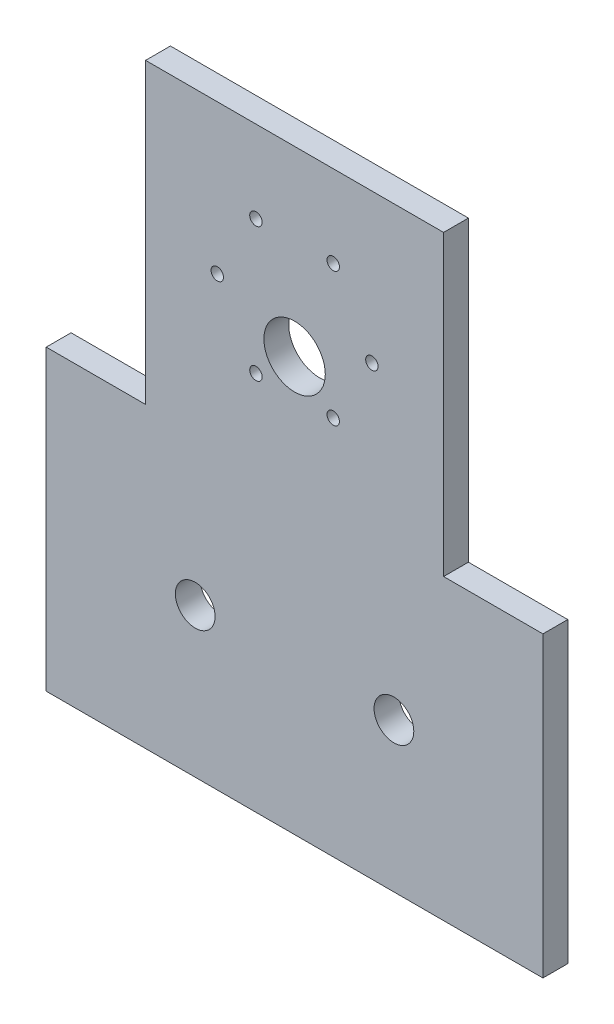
ISO-10303-21;
HEADER;
FILE_DESCRIPTION(('STEP AP214'),'2;1');
FILE_NAME('part.step','',(''),(''),'','','');
FILE_SCHEMA(('AUTOMOTIVE_DESIGN { 1 0 10303 214 1 1 1 1 }'));
ENDSEC;
DATA;
#1=APPLICATION_CONTEXT('core data for automotive mechanical design processes');
#2=APPLICATION_PROTOCOL_DEFINITION('international standard','automotive_design',2000,#1);
#3=PRODUCT_CONTEXT('',#1,'mechanical');
#4=PRODUCT('Part','Part','',(#3));
#5=PRODUCT_RELATED_PRODUCT_CATEGORY('part','',(#4));
#6=PRODUCT_DEFINITION_FORMATION('','',#4);
#7=PRODUCT_DEFINITION_CONTEXT('part definition',#1,'design');
#8=PRODUCT_DEFINITION('design','',#6,#7);
#9=PRODUCT_DEFINITION_SHAPE('','',#8);
#10=(LENGTH_UNIT() NAMED_UNIT(*) SI_UNIT(.MILLI.,.METRE.));
#11=(NAMED_UNIT(*) PLANE_ANGLE_UNIT() SI_UNIT($,.RADIAN.));
#12=(NAMED_UNIT(*) SI_UNIT($,.STERADIAN.) SOLID_ANGLE_UNIT());
#13=UNCERTAINTY_MEASURE_WITH_UNIT(LENGTH_MEASURE(1.E-05),#10,'distance_accuracy_value','');
#14=(GEOMETRIC_REPRESENTATION_CONTEXT(3) GLOBAL_UNCERTAINTY_ASSIGNED_CONTEXT((#13)) GLOBAL_UNIT_ASSIGNED_CONTEXT((#10,
#11,#12)) REPRESENTATION_CONTEXT('',''));
#15=CARTESIAN_POINT('',(0.,0.,0.));
#16=DIRECTION('',(0.,0.,1.));
#17=DIRECTION('',(1.,0.,0.));
#18=AXIS2_PLACEMENT_3D('',#15,#16,#17);
#19=CARTESIAN_POINT('',(0.,0.,5.));
#20=DIRECTION('',(0.,0.,-1.));
#21=DIRECTION('',(-1.,0.,0.));
#22=AXIS2_PLACEMENT_3D('',#19,#20,#21);
#23=PLANE('',#22);
#24=DIRECTION('',(0.,1.,0.));
#25=VECTOR('',#24,1.);
#26=CARTESIAN_POINT('',(0.,0.,5.));
#27=LINE('',#26,#25);
#28=CARTESIAN_POINT('',(0.,0.,5.));
#29=VERTEX_POINT('',#28);
#30=CARTESIAN_POINT('',(0.,60.,5.));
#31=VERTEX_POINT('',#30);
#32=EDGE_CURVE('E423',#29,#31,#27,.T.);
#33=ORIENTED_EDGE('',*,*,#32,.F.);
#34=DIRECTION('',(1.,0.,0.));
#35=VECTOR('',#34,1.);
#36=CARTESIAN_POINT('',(0.,0.,5.));
#37=LINE('',#36,#35);
#38=CARTESIAN_POINT('',(100.,0.,5.));
#39=VERTEX_POINT('',#38);
#40=EDGE_CURVE('E358',#29,#39,#37,.T.);
#41=ORIENTED_EDGE('',*,*,#40,.T.);
#42=DIRECTION('',(0.,1.,0.));
#43=VECTOR('',#42,1.);
#44=CARTESIAN_POINT('',(100.,0.,5.));
#45=LINE('',#44,#43);
#46=CARTESIAN_POINT('',(100.,60.,5.));
#47=VERTEX_POINT('',#46);
#48=EDGE_CURVE('E350',#39,#47,#45,.T.);
#49=ORIENTED_EDGE('',*,*,#48,.T.);
#50=DIRECTION('',(1.,0.,0.));
#51=VECTOR('',#50,1.);
#52=CARTESIAN_POINT('',(80.,60.,5.));
#53=LINE('',#52,#51);
#54=CARTESIAN_POINT('',(80.,60.,5.));
#55=VERTEX_POINT('',#54);
#56=EDGE_CURVE('E356',#55,#47,#53,.T.);
#57=ORIENTED_EDGE('',*,*,#56,.F.);
#58=DIRECTION('',(0.,-1.,0.));
#59=VECTOR('',#58,1.);
#60=CARTESIAN_POINT('',(80.,120.,5.));
#61=LINE('',#60,#59);
#62=CARTESIAN_POINT('',(80.,120.,5.));
#63=VERTEX_POINT('',#62);
#64=EDGE_CURVE('E372',#63,#55,#61,.T.);
#65=ORIENTED_EDGE('',*,*,#64,.F.);
#66=DIRECTION('',(1.,0.,0.));
#67=VECTOR('',#66,1.);
#68=CARTESIAN_POINT('',(20.,120.,5.));
#69=LINE('',#68,#67);
#70=CARTESIAN_POINT('',(20.,120.,5.));
#71=VERTEX_POINT('',#70);
#72=EDGE_CURVE('E374',#71,#63,#69,.T.);
#73=ORIENTED_EDGE('',*,*,#72,.F.);
#74=DIRECTION('',(0.,-1.,0.));
#75=VECTOR('',#74,1.);
#76=CARTESIAN_POINT('',(20.,120.,5.));
#77=LINE('',#76,#75);
#78=CARTESIAN_POINT('',(20.,60.,5.));
#79=VERTEX_POINT('',#78);
#80=EDGE_CURVE('E513',#71,#79,#77,.T.);
#81=ORIENTED_EDGE('',*,*,#80,.T.);
#82=DIRECTION('',(1.,0.,0.));
#83=VECTOR('',#82,1.);
#84=CARTESIAN_POINT('',(0.,60.,5.));
#85=LINE('',#84,#83);
#86=EDGE_CURVE('E511',#31,#79,#85,.T.);
#87=ORIENTED_EDGE('',*,*,#86,.F.);
#88=EDGE_LOOP('',(#33,#41,#49,#57,#65,#73,#81,#87));
#89=FACE_BOUND('',#88,.T.);
#90=CARTESIAN_POINT('',(50.,83.35,5.));
#91=DIRECTION('',(0.,0.,1.));
#92=DIRECTION('',(1.,0.,0.));
#93=AXIS2_PLACEMENT_3D('',#90,#91,#92);
#94=CIRCLE('',#93,6.18);
#95=CARTESIAN_POINT('',(56.18,83.35,5.));
#96=VERTEX_POINT('',#95);
#97=EDGE_CURVE('E385',#96,#96,#94,.T.);
#98=ORIENTED_EDGE('',*,*,#97,.F.);
#99=EDGE_LOOP('',(#98));
#100=FACE_BOUND('',#99,.T.);
#101=CARTESIAN_POINT('',(34.44,90.0000000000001,5.));
#102=DIRECTION('',(0.,0.,1.));
#103=DIRECTION('',(1.,0.,0.));
#104=AXIS2_PLACEMENT_3D('',#101,#102,#103);
#105=CIRCLE('',#104,1.24999999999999);
#106=CARTESIAN_POINT('',(35.69,90.0000000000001,5.));
#107=VERTEX_POINT('',#106);
#108=EDGE_CURVE('E445',#107,#107,#105,.T.);
#109=ORIENTED_EDGE('',*,*,#108,.F.);
#110=EDGE_LOOP('',(#109));
#111=FACE_BOUND('',#110,.T.);
#112=CARTESIAN_POINT('',(57.7800000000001,103.475355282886,5.));
#113=DIRECTION('',(0.,0.,1.));
#114=DIRECTION('',(1.,0.,0.));
#115=AXIS2_PLACEMENT_3D('',#112,#113,#114);
#116=CIRCLE('',#115,1.25);
#117=CARTESIAN_POINT('',(59.0300000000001,103.475355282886,5.));
#118=VERTEX_POINT('',#117);
#119=EDGE_CURVE('E450',#118,#118,#116,.T.);
#120=ORIENTED_EDGE('',*,*,#119,.F.);
#121=EDGE_LOOP('',(#120));
#122=FACE_BOUND('',#121,.T.);
#123=CARTESIAN_POINT('',(65.56,90.,5.));
#124=DIRECTION('',(0.,0.,1.));
#125=DIRECTION('',(1.,0.,0.));
#126=AXIS2_PLACEMENT_3D('',#123,#124,#125);
#127=CIRCLE('',#126,1.25);
#128=CARTESIAN_POINT('',(66.81,90.,5.));
#129=VERTEX_POINT('',#128);
#130=EDGE_CURVE('E451',#129,#129,#127,.T.);
#131=ORIENTED_EDGE('',*,*,#130,.F.);
#132=EDGE_LOOP('',(#131));
#133=FACE_BOUND('',#132,.T.);
#134=CARTESIAN_POINT('',(42.2199999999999,76.5246447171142,5.));
#135=DIRECTION('',(0.,0.,1.));
#136=DIRECTION('',(1.,0.,0.));
#137=AXIS2_PLACEMENT_3D('',#134,#135,#136);
#138=CIRCLE('',#137,1.25);
#139=CARTESIAN_POINT('',(43.4699999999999,76.5246447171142,5.));
#140=VERTEX_POINT('',#139);
#141=EDGE_CURVE('E456',#140,#140,#138,.T.);
#142=ORIENTED_EDGE('',*,*,#141,.F.);
#143=EDGE_LOOP('',(#142));
#144=FACE_BOUND('',#143,.T.);
#145=CARTESIAN_POINT('',(70.,30.,5.));
#146=DIRECTION('',(0.,0.,1.));
#147=DIRECTION('',(1.,0.,0.));
#148=AXIS2_PLACEMENT_3D('',#145,#146,#147);
#149=CIRCLE('',#148,4.00000000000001);
#150=CARTESIAN_POINT('',(74.,30.,5.));
#151=VERTEX_POINT('',#150);
#152=EDGE_CURVE('E457',#151,#151,#149,.T.);
#153=ORIENTED_EDGE('',*,*,#152,.F.);
#154=EDGE_LOOP('',(#153));
#155=FACE_BOUND('',#154,.T.);
#156=CARTESIAN_POINT('',(42.2200000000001,103.475355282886,5.));
#157=DIRECTION('',(0.,0.,1.));
#158=DIRECTION('',(1.,0.,0.));
#159=AXIS2_PLACEMENT_3D('',#156,#157,#158);
#160=CIRCLE('',#159,1.25);
#161=CARTESIAN_POINT('',(43.4700000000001,103.475355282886,5.));
#162=VERTEX_POINT('',#161);
#163=EDGE_CURVE('E462',#162,#162,#160,.T.);
#164=ORIENTED_EDGE('',*,*,#163,.F.);
#165=EDGE_LOOP('',(#164));
#166=FACE_BOUND('',#165,.T.);
#167=CARTESIAN_POINT('',(57.78,76.5246447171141,5.));
#168=DIRECTION('',(0.,0.,1.));
#169=DIRECTION('',(1.,0.,0.));
#170=AXIS2_PLACEMENT_3D('',#167,#168,#169);
#171=CIRCLE('',#170,1.24999999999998);
#172=CARTESIAN_POINT('',(59.0299999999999,76.5246447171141,5.));
#173=VERTEX_POINT('',#172);
#174=EDGE_CURVE('E463',#173,#173,#171,.T.);
#175=ORIENTED_EDGE('',*,*,#174,.F.);
#176=EDGE_LOOP('',(#175));
#177=FACE_BOUND('',#176,.T.);
#178=CARTESIAN_POINT('',(30.,30.,5.));
#179=DIRECTION('',(0.,0.,1.));
#180=DIRECTION('',(1.,0.,0.));
#181=AXIS2_PLACEMENT_3D('',#178,#179,#180);
#182=CIRCLE('',#181,4.00000000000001);
#183=CARTESIAN_POINT('',(34.,30.,5.));
#184=VERTEX_POINT('',#183);
#185=EDGE_CURVE('E467',#184,#184,#182,.T.);
#186=ORIENTED_EDGE('',*,*,#185,.F.);
#187=EDGE_LOOP('',(#186));
#188=FACE_BOUND('',#187,.T.);
#189=ADVANCED_FACE('F279',(#89,#100,#111,#122,#133,#144,#155,#166,#177,#188),#23,.F.);
#190=CARTESIAN_POINT('',(0.,0.,0.));
#191=DIRECTION('',(0.,0.,-1.));
#192=DIRECTION('',(-1.,0.,0.));
#193=AXIS2_PLACEMENT_3D('',#190,#191,#192);
#194=PLANE('',#193);
#195=CARTESIAN_POINT('',(57.78,76.5246447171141,0.));
#196=DIRECTION('',(0.,0.,1.));
#197=DIRECTION('',(1.,0.,0.));
#198=AXIS2_PLACEMENT_3D('',#195,#196,#197);
#199=CIRCLE('',#198,1.24999999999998);
#200=CARTESIAN_POINT('',(59.0299999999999,76.5246447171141,0.));
#201=VERTEX_POINT('',#200);
#202=EDGE_CURVE('E471',#201,#201,#199,.T.);
#203=ORIENTED_EDGE('',*,*,#202,.T.);
#204=EDGE_LOOP('',(#203));
#205=FACE_BOUND('',#204,.T.);
#206=CARTESIAN_POINT('',(70.,30.,0.));
#207=DIRECTION('',(0.,0.,1.));
#208=DIRECTION('',(1.,0.,0.));
#209=AXIS2_PLACEMENT_3D('',#206,#207,#208);
#210=CIRCLE('',#209,4.00000000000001);
#211=CARTESIAN_POINT('',(74.,30.,0.));
#212=VERTEX_POINT('',#211);
#213=EDGE_CURVE('E485',#212,#212,#210,.T.);
#214=ORIENTED_EDGE('',*,*,#213,.T.);
#215=EDGE_LOOP('',(#214));
#216=FACE_BOUND('',#215,.T.);
#217=CARTESIAN_POINT('',(65.56,90.,0.));
#218=DIRECTION('',(0.,0.,1.));
#219=DIRECTION('',(1.,0.,0.));
#220=AXIS2_PLACEMENT_3D('',#217,#218,#219);
#221=CIRCLE('',#220,1.25);
#222=CARTESIAN_POINT('',(66.81,90.,0.));
#223=VERTEX_POINT('',#222);
#224=EDGE_CURVE('E492',#223,#223,#221,.T.);
#225=ORIENTED_EDGE('',*,*,#224,.T.);
#226=EDGE_LOOP('',(#225));
#227=FACE_BOUND('',#226,.T.);
#228=CARTESIAN_POINT('',(34.44,90.0000000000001,0.));
#229=DIRECTION('',(0.,0.,1.));
#230=DIRECTION('',(1.,0.,0.));
#231=AXIS2_PLACEMENT_3D('',#228,#229,#230);
#232=CIRCLE('',#231,1.24999999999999);
#233=CARTESIAN_POINT('',(35.69,90.0000000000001,0.));
#234=VERTEX_POINT('',#233);
#235=EDGE_CURVE('E502',#234,#234,#232,.T.);
#236=ORIENTED_EDGE('',*,*,#235,.T.);
#237=EDGE_LOOP('',(#236));
#238=FACE_BOUND('',#237,.T.);
#239=DIRECTION('',(0.,1.,0.));
#240=VECTOR('',#239,1.);
#241=CARTESIAN_POINT('',(0.,0.,0.));
#242=LINE('',#241,#240);
#243=CARTESIAN_POINT('',(0.,0.,0.));
#244=VERTEX_POINT('',#243);
#245=CARTESIAN_POINT('',(0.,60.,0.));
#246=VERTEX_POINT('',#245);
#247=EDGE_CURVE('E379',#244,#246,#242,.T.);
#248=ORIENTED_EDGE('',*,*,#247,.T.);
#249=DIRECTION('',(1.,0.,0.));
#250=VECTOR('',#249,1.);
#251=CARTESIAN_POINT('',(0.,60.,0.));
#252=LINE('',#251,#250);
#253=CARTESIAN_POINT('',(20.,60.,0.));
#254=VERTEX_POINT('',#253);
#255=EDGE_CURVE('E384',#246,#254,#252,.T.);
#256=ORIENTED_EDGE('',*,*,#255,.T.);
#257=DIRECTION('',(0.,-1.,0.));
#258=VECTOR('',#257,1.);
#259=CARTESIAN_POINT('',(20.,120.,0.));
#260=LINE('',#259,#258);
#261=CARTESIAN_POINT('',(20.,120.,0.));
#262=VERTEX_POINT('',#261);
#263=EDGE_CURVE('E397',#262,#254,#260,.T.);
#264=ORIENTED_EDGE('',*,*,#263,.F.);
#265=DIRECTION('',(1.,0.,0.));
#266=VECTOR('',#265,1.);
#267=CARTESIAN_POINT('',(20.,120.,0.));
#268=LINE('',#267,#266);
#269=CARTESIAN_POINT('',(80.,120.,0.));
#270=VERTEX_POINT('',#269);
#271=EDGE_CURVE('E401',#262,#270,#268,.T.);
#272=ORIENTED_EDGE('',*,*,#271,.T.);
#273=DIRECTION('',(0.,-1.,0.));
#274=VECTOR('',#273,1.);
#275=CARTESIAN_POINT('',(80.,120.,0.));
#276=LINE('',#275,#274);
#277=CARTESIAN_POINT('',(80.,60.,0.));
#278=VERTEX_POINT('',#277);
#279=EDGE_CURVE('E406',#270,#278,#276,.T.);
#280=ORIENTED_EDGE('',*,*,#279,.T.);
#281=DIRECTION('',(1.,0.,0.));
#282=VECTOR('',#281,1.);
#283=CARTESIAN_POINT('',(80.,60.,0.));
#284=LINE('',#283,#282);
#285=CARTESIAN_POINT('',(100.,60.,0.));
#286=VERTEX_POINT('',#285);
#287=EDGE_CURVE('E411',#278,#286,#284,.T.);
#288=ORIENTED_EDGE('',*,*,#287,.T.);
#289=DIRECTION('',(0.,1.,0.));
#290=VECTOR('',#289,1.);
#291=CARTESIAN_POINT('',(100.,0.,0.));
#292=LINE('',#291,#290);
#293=CARTESIAN_POINT('',(100.,0.,0.));
#294=VERTEX_POINT('',#293);
#295=EDGE_CURVE('E365',#294,#286,#292,.T.);
#296=ORIENTED_EDGE('',*,*,#295,.F.);
#297=DIRECTION('',(1.,0.,0.));
#298=VECTOR('',#297,1.);
#299=CARTESIAN_POINT('',(0.,0.,0.));
#300=LINE('',#299,#298);
#301=EDGE_CURVE('E325',#244,#294,#300,.T.);
#302=ORIENTED_EDGE('',*,*,#301,.F.);
#303=EDGE_LOOP('',(#248,#256,#264,#272,#280,#288,#296,#302));
#304=FACE_BOUND('',#303,.T.);
#305=CARTESIAN_POINT('',(50.,83.35,0.));
#306=DIRECTION('',(0.,0.,1.));
#307=DIRECTION('',(1.,0.,0.));
#308=AXIS2_PLACEMENT_3D('',#305,#306,#307);
#309=CIRCLE('',#308,6.18);
#310=CARTESIAN_POINT('',(56.18,83.35,0.));
#311=VERTEX_POINT('',#310);
#312=EDGE_CURVE('E442',#311,#311,#309,.T.);
#313=ORIENTED_EDGE('',*,*,#312,.T.);
#314=EDGE_LOOP('',(#313));
#315=FACE_BOUND('',#314,.T.);
#316=CARTESIAN_POINT('',(57.7800000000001,103.475355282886,0.));
#317=DIRECTION('',(0.,0.,1.));
#318=DIRECTION('',(1.,0.,0.));
#319=AXIS2_PLACEMENT_3D('',#316,#317,#318);
#320=CIRCLE('',#319,1.25);
#321=CARTESIAN_POINT('',(59.0300000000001,103.475355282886,0.));
#322=VERTEX_POINT('',#321);
#323=EDGE_CURVE('E447',#322,#322,#320,.T.);
#324=ORIENTED_EDGE('',*,*,#323,.T.);
#325=EDGE_LOOP('',(#324));
#326=FACE_BOUND('',#325,.T.);
#327=CARTESIAN_POINT('',(42.2199999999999,76.5246447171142,0.));
#328=DIRECTION('',(0.,0.,1.));
#329=DIRECTION('',(1.,0.,0.));
#330=AXIS2_PLACEMENT_3D('',#327,#328,#329);
#331=CIRCLE('',#330,1.25);
#332=CARTESIAN_POINT('',(43.4699999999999,76.5246447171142,0.));
#333=VERTEX_POINT('',#332);
#334=EDGE_CURVE('E453',#333,#333,#331,.T.);
#335=ORIENTED_EDGE('',*,*,#334,.T.);
#336=EDGE_LOOP('',(#335));
#337=FACE_BOUND('',#336,.T.);
#338=CARTESIAN_POINT('',(42.2200000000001,103.475355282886,0.));
#339=DIRECTION('',(0.,0.,1.));
#340=DIRECTION('',(1.,0.,0.));
#341=AXIS2_PLACEMENT_3D('',#338,#339,#340);
#342=CIRCLE('',#341,1.25);
#343=CARTESIAN_POINT('',(43.4700000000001,103.475355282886,0.));
#344=VERTEX_POINT('',#343);
#345=EDGE_CURVE('E459',#344,#344,#342,.T.);
#346=ORIENTED_EDGE('',*,*,#345,.T.);
#347=EDGE_LOOP('',(#346));
#348=FACE_BOUND('',#347,.T.);
#349=CARTESIAN_POINT('',(30.,30.,0.));
#350=DIRECTION('',(0.,0.,1.));
#351=DIRECTION('',(1.,0.,0.));
#352=AXIS2_PLACEMENT_3D('',#349,#350,#351);
#353=CIRCLE('',#352,4.00000000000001);
#354=CARTESIAN_POINT('',(34.,30.,0.));
#355=VERTEX_POINT('',#354);
#356=EDGE_CURVE('E465',#355,#355,#353,.T.);
#357=ORIENTED_EDGE('',*,*,#356,.T.);
#358=EDGE_LOOP('',(#357));
#359=FACE_BOUND('',#358,.T.);
#360=ADVANCED_FACE('F437',(#205,#216,#227,#238,#304,#315,#326,#337,#348,#359),#194,.T.);
#361=CARTESIAN_POINT('',(0.,0.,5.));
#362=DIRECTION('',(-1.,0.,0.));
#363=DIRECTION('',(0.,0.,1.));
#364=AXIS2_PLACEMENT_3D('',#361,#362,#363);
#365=PLANE('',#364);
#366=ORIENTED_EDGE('',*,*,#247,.F.);
#367=DIRECTION('',(0.,0.,-1.));
#368=VECTOR('',#367,1.);
#369=CARTESIAN_POINT('',(0.,0.,5.));
#370=LINE('',#369,#368);
#371=EDGE_CURVE('E13',#29,#244,#370,.T.);
#372=ORIENTED_EDGE('',*,*,#371,.F.);
#373=ORIENTED_EDGE('',*,*,#32,.T.);
#374=DIRECTION('',(0.,0.,-1.));
#375=VECTOR('',#374,1.);
#376=CARTESIAN_POINT('',(0.,60.,5.));
#377=LINE('',#376,#375);
#378=EDGE_CURVE('E283',#31,#246,#377,.T.);
#379=ORIENTED_EDGE('',*,*,#378,.T.);
#380=EDGE_LOOP('',(#366,#372,#373,#379));
#381=FACE_BOUND('',#380,.T.);
#382=ADVANCED_FACE('F281',(#381),#365,.T.);
#383=CARTESIAN_POINT('',(0.,0.,5.));
#384=DIRECTION('',(0.,1.,0.));
#385=DIRECTION('',(0.,0.,1.));
#386=AXIS2_PLACEMENT_3D('',#383,#384,#385);
#387=PLANE('',#386);
#388=ORIENTED_EDGE('',*,*,#301,.T.);
#389=DIRECTION('',(0.,0.,-1.));
#390=VECTOR('',#389,1.);
#391=CARTESIAN_POINT('',(100.,0.,5.));
#392=LINE('',#391,#390);
#393=EDGE_CURVE('E289',#39,#294,#392,.T.);
#394=ORIENTED_EDGE('',*,*,#393,.F.);
#395=ORIENTED_EDGE('',*,*,#40,.F.);
#396=ORIENTED_EDGE('',*,*,#371,.T.);
#397=EDGE_LOOP('',(#388,#394,#395,#396));
#398=FACE_BOUND('',#397,.T.);
#399=ADVANCED_FACE('F542',(#398),#387,.F.);
#400=CARTESIAN_POINT('',(100.,0.,5.));
#401=DIRECTION('',(-1.,0.,0.));
#402=DIRECTION('',(0.,0.,1.));
#403=AXIS2_PLACEMENT_3D('',#400,#401,#402);
#404=PLANE('',#403);
#405=ORIENTED_EDGE('',*,*,#295,.T.);
#406=DIRECTION('',(0.,0.,-1.));
#407=VECTOR('',#406,1.);
#408=CARTESIAN_POINT('',(100.,60.,5.));
#409=LINE('',#408,#407);
#410=EDGE_CURVE('E362',#47,#286,#409,.T.);
#411=ORIENTED_EDGE('',*,*,#410,.F.);
#412=ORIENTED_EDGE('',*,*,#48,.F.);
#413=ORIENTED_EDGE('',*,*,#393,.T.);
#414=EDGE_LOOP('',(#405,#411,#412,#413));
#415=FACE_BOUND('',#414,.T.);
#416=ADVANCED_FACE('F363',(#415),#404,.F.);
#417=CARTESIAN_POINT('',(80.,60.,5.));
#418=DIRECTION('',(0.,1.,0.));
#419=DIRECTION('',(0.,0.,1.));
#420=AXIS2_PLACEMENT_3D('',#417,#418,#419);
#421=PLANE('',#420);
#422=ORIENTED_EDGE('',*,*,#287,.F.);
#423=DIRECTION('',(0.,0.,-1.));
#424=VECTOR('',#423,1.);
#425=CARTESIAN_POINT('',(80.,60.,5.));
#426=LINE('',#425,#424);
#427=EDGE_CURVE('E369',#55,#278,#426,.T.);
#428=ORIENTED_EDGE('',*,*,#427,.F.);
#429=ORIENTED_EDGE('',*,*,#56,.T.);
#430=ORIENTED_EDGE('',*,*,#410,.T.);
#431=EDGE_LOOP('',(#422,#428,#429,#430));
#432=FACE_BOUND('',#431,.T.);
#433=ADVANCED_FACE('F371',(#432),#421,.T.);
#434=CARTESIAN_POINT('',(80.,120.,5.));
#435=DIRECTION('',(1.,0.,0.));
#436=DIRECTION('',(0.,0.,-1.));
#437=AXIS2_PLACEMENT_3D('',#434,#435,#436);
#438=PLANE('',#437);
#439=ORIENTED_EDGE('',*,*,#279,.F.);
#440=DIRECTION('',(0.,0.,-1.));
#441=VECTOR('',#440,1.);
#442=CARTESIAN_POINT('',(80.,120.,5.));
#443=LINE('',#442,#441);
#444=EDGE_CURVE('E427',#63,#270,#443,.T.);
#445=ORIENTED_EDGE('',*,*,#444,.F.);
#446=ORIENTED_EDGE('',*,*,#64,.T.);
#447=ORIENTED_EDGE('',*,*,#427,.T.);
#448=EDGE_LOOP('',(#439,#445,#446,#447));
#449=FACE_BOUND('',#448,.T.);
#450=ADVANCED_FACE('F521',(#449),#438,.T.);
#451=CARTESIAN_POINT('',(20.,120.,5.));
#452=DIRECTION('',(0.,1.,0.));
#453=DIRECTION('',(0.,0.,1.));
#454=AXIS2_PLACEMENT_3D('',#451,#452,#453);
#455=PLANE('',#454);
#456=ORIENTED_EDGE('',*,*,#271,.F.);
#457=DIRECTION('',(0.,0.,-1.));
#458=VECTOR('',#457,1.);
#459=CARTESIAN_POINT('',(20.,120.,5.));
#460=LINE('',#459,#458);
#461=EDGE_CURVE('E429',#71,#262,#460,.T.);
#462=ORIENTED_EDGE('',*,*,#461,.F.);
#463=ORIENTED_EDGE('',*,*,#72,.T.);
#464=ORIENTED_EDGE('',*,*,#444,.T.);
#465=EDGE_LOOP('',(#456,#462,#463,#464));
#466=FACE_BOUND('',#465,.T.);
#467=ADVANCED_FACE('F518',(#466),#455,.T.);
#468=CARTESIAN_POINT('',(20.,120.,5.));
#469=DIRECTION('',(1.,0.,0.));
#470=DIRECTION('',(0.,1.,0.));
#471=AXIS2_PLACEMENT_3D('',#468,#469,#470);
#472=PLANE('',#471);
#473=ORIENTED_EDGE('',*,*,#263,.T.);
#474=DIRECTION('',(0.,0.,-1.));
#475=VECTOR('',#474,1.);
#476=CARTESIAN_POINT('',(20.,60.,5.));
#477=LINE('',#476,#475);
#478=EDGE_CURVE('E430',#79,#254,#477,.T.);
#479=ORIENTED_EDGE('',*,*,#478,.F.);
#480=ORIENTED_EDGE('',*,*,#80,.F.);
#481=ORIENTED_EDGE('',*,*,#461,.T.);
#482=EDGE_LOOP('',(#473,#479,#480,#481));
#483=FACE_BOUND('',#482,.T.);
#484=ADVANCED_FACE('F523',(#483),#472,.F.);
#485=CARTESIAN_POINT('',(0.,60.,5.));
#486=DIRECTION('',(0.,1.,0.));
#487=DIRECTION('',(0.,0.,1.));
#488=AXIS2_PLACEMENT_3D('',#485,#486,#487);
#489=PLANE('',#488);
#490=ORIENTED_EDGE('',*,*,#255,.F.);
#491=ORIENTED_EDGE('',*,*,#378,.F.);
#492=ORIENTED_EDGE('',*,*,#86,.T.);
#493=ORIENTED_EDGE('',*,*,#478,.T.);
#494=EDGE_LOOP('',(#490,#491,#492,#493));
#495=FACE_BOUND('',#494,.T.);
#496=ADVANCED_FACE('F433',(#495),#489,.T.);
#497=CARTESIAN_POINT('',(50.,83.35,5.));
#498=DIRECTION('',(0.,0.,-1.));
#499=DIRECTION('',(-1.,0.,0.));
#500=AXIS2_PLACEMENT_3D('',#497,#498,#499);
#501=CYLINDRICAL_SURFACE('',#500,6.18);
#502=ORIENTED_EDGE('',*,*,#97,.T.);
#503=EDGE_LOOP('',(#502));
#504=FACE_BOUND('',#503,.T.);
#505=ORIENTED_EDGE('',*,*,#312,.F.);
#506=EDGE_LOOP('',(#505));
#507=FACE_BOUND('',#506,.T.);
#508=ADVANCED_FACE('F530',(#504,#507),#501,.F.);
#509=CARTESIAN_POINT('',(34.44,90.0000000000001,5.));
#510=DIRECTION('',(0.,0.,-1.));
#511=DIRECTION('',(-1.,0.,0.));
#512=AXIS2_PLACEMENT_3D('',#509,#510,#511);
#513=CYLINDRICAL_SURFACE('',#512,1.24999999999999);
#514=ORIENTED_EDGE('',*,*,#108,.T.);
#515=EDGE_LOOP('',(#514));
#516=FACE_BOUND('',#515,.T.);
#517=ORIENTED_EDGE('',*,*,#235,.F.);
#518=EDGE_LOOP('',(#517));
#519=FACE_BOUND('',#518,.T.);
#520=ADVANCED_FACE('F577',(#516,#519),#513,.F.);
#521=CARTESIAN_POINT('',(57.7800000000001,103.475355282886,5.));
#522=DIRECTION('',(0.,0.,-1.));
#523=DIRECTION('',(-1.,0.,0.));
#524=AXIS2_PLACEMENT_3D('',#521,#522,#523);
#525=CYLINDRICAL_SURFACE('',#524,1.25);
#526=ORIENTED_EDGE('',*,*,#119,.T.);
#527=EDGE_LOOP('',(#526));
#528=FACE_BOUND('',#527,.T.);
#529=ORIENTED_EDGE('',*,*,#323,.F.);
#530=EDGE_LOOP('',(#529));
#531=FACE_BOUND('',#530,.T.);
#532=ADVANCED_FACE('F586',(#528,#531),#525,.F.);
#533=CARTESIAN_POINT('',(65.56,90.,5.));
#534=DIRECTION('',(0.,0.,-1.));
#535=DIRECTION('',(-1.,0.,0.));
#536=AXIS2_PLACEMENT_3D('',#533,#534,#535);
#537=CYLINDRICAL_SURFACE('',#536,1.25);
#538=ORIENTED_EDGE('',*,*,#130,.T.);
#539=EDGE_LOOP('',(#538));
#540=FACE_BOUND('',#539,.T.);
#541=ORIENTED_EDGE('',*,*,#224,.F.);
#542=EDGE_LOOP('',(#541));
#543=FACE_BOUND('',#542,.T.);
#544=ADVANCED_FACE('F595',(#540,#543),#537,.F.);
#545=CARTESIAN_POINT('',(42.2199999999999,76.5246447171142,5.));
#546=DIRECTION('',(0.,0.,-1.));
#547=DIRECTION('',(-1.,0.,0.));
#548=AXIS2_PLACEMENT_3D('',#545,#546,#547);
#549=CYLINDRICAL_SURFACE('',#548,1.25);
#550=ORIENTED_EDGE('',*,*,#141,.T.);
#551=EDGE_LOOP('',(#550));
#552=FACE_BOUND('',#551,.T.);
#553=ORIENTED_EDGE('',*,*,#334,.F.);
#554=EDGE_LOOP('',(#553));
#555=FACE_BOUND('',#554,.T.);
#556=ADVANCED_FACE('F605',(#552,#555),#549,.F.);
#557=CARTESIAN_POINT('',(70.,30.,5.));
#558=DIRECTION('',(0.,0.,-1.));
#559=DIRECTION('',(-1.,0.,0.));
#560=AXIS2_PLACEMENT_3D('',#557,#558,#559);
#561=CYLINDRICAL_SURFACE('',#560,4.00000000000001);
#562=ORIENTED_EDGE('',*,*,#152,.T.);
#563=EDGE_LOOP('',(#562));
#564=FACE_BOUND('',#563,.T.);
#565=ORIENTED_EDGE('',*,*,#213,.F.);
#566=EDGE_LOOP('',(#565));
#567=FACE_BOUND('',#566,.T.);
#568=ADVANCED_FACE('F615',(#564,#567),#561,.F.);
#569=CARTESIAN_POINT('',(42.2200000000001,103.475355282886,5.));
#570=DIRECTION('',(0.,0.,-1.));
#571=DIRECTION('',(-1.,0.,0.));
#572=AXIS2_PLACEMENT_3D('',#569,#570,#571);
#573=CYLINDRICAL_SURFACE('',#572,1.25);
#574=ORIENTED_EDGE('',*,*,#163,.T.);
#575=EDGE_LOOP('',(#574));
#576=FACE_BOUND('',#575,.T.);
#577=ORIENTED_EDGE('',*,*,#345,.F.);
#578=EDGE_LOOP('',(#577));
#579=FACE_BOUND('',#578,.T.);
#580=ADVANCED_FACE('F625',(#576,#579),#573,.F.);
#581=CARTESIAN_POINT('',(57.78,76.5246447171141,5.));
#582=DIRECTION('',(0.,0.,-1.));
#583=DIRECTION('',(-1.,0.,0.));
#584=AXIS2_PLACEMENT_3D('',#581,#582,#583);
#585=CYLINDRICAL_SURFACE('',#584,1.24999999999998);
#586=ORIENTED_EDGE('',*,*,#174,.T.);
#587=EDGE_LOOP('',(#586));
#588=FACE_BOUND('',#587,.T.);
#589=ORIENTED_EDGE('',*,*,#202,.F.);
#590=EDGE_LOOP('',(#589));
#591=FACE_BOUND('',#590,.T.);
#592=ADVANCED_FACE('F635',(#588,#591),#585,.F.);
#593=CARTESIAN_POINT('',(30.,30.,5.));
#594=DIRECTION('',(0.,0.,-1.));
#595=DIRECTION('',(-1.,0.,0.));
#596=AXIS2_PLACEMENT_3D('',#593,#594,#595);
#597=CYLINDRICAL_SURFACE('',#596,4.00000000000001);
#598=ORIENTED_EDGE('',*,*,#185,.T.);
#599=EDGE_LOOP('',(#598));
#600=FACE_BOUND('',#599,.T.);
#601=ORIENTED_EDGE('',*,*,#356,.F.);
#602=EDGE_LOOP('',(#601));
#603=FACE_BOUND('',#602,.T.);
#604=ADVANCED_FACE('F645',(#600,#603),#597,.F.);
#605=CLOSED_SHELL('',(#189,#360,#382,#399,#416,#433,#450,#467,#484,#496,#508,#520,#532,#544,
#556,#568,#580,#592,#604));
#606=MANIFOLD_SOLID_BREP('B2',#605);
#607=ADVANCED_BREP_SHAPE_REPRESENTATION('',(#18,#606),#14);
#608=SHAPE_DEFINITION_REPRESENTATION(#9,#607);
ENDSEC;
END-ISO-10303-21;
